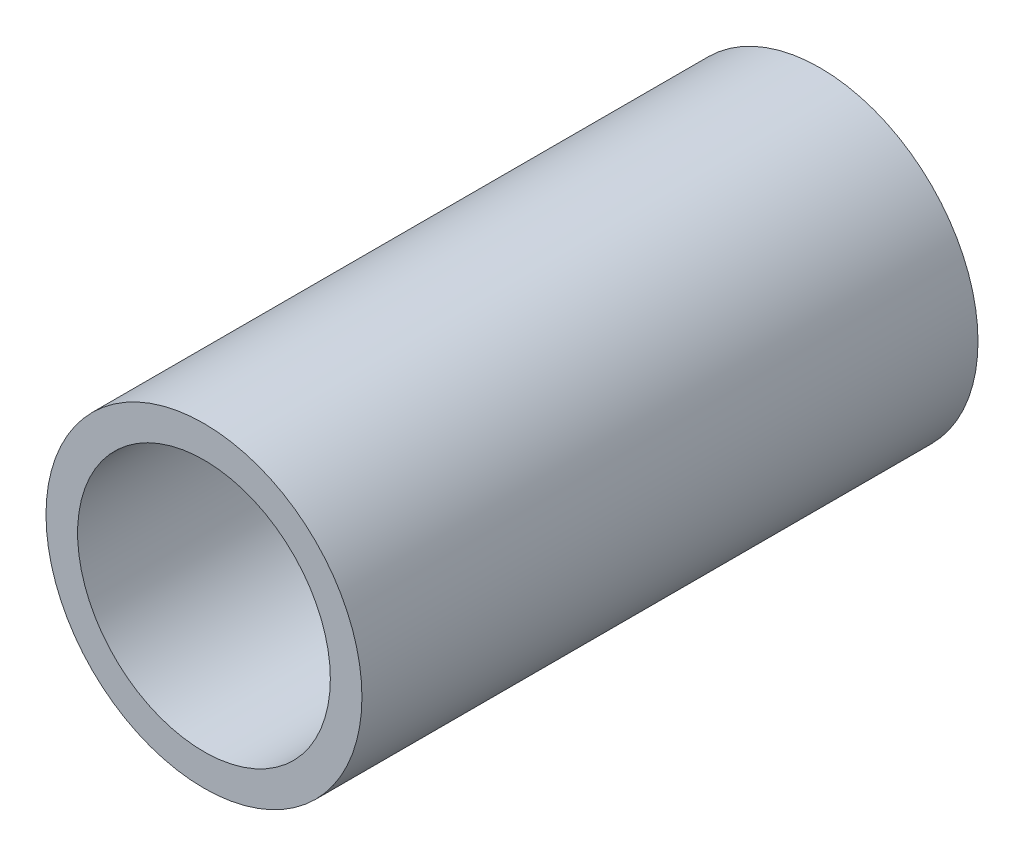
from build123d import *

# Parameters (mm, degrees)
SKETCH_1_R      = 5
SKETCH_1_R_2    = 4
EXTRUDE_1_DEPTH = 19.5


with BuildPart() as part:
    # Sketch 1 → Extrude 1 (new body)
    with BuildSketch(Plane.XY):
        Circle(SKETCH_1_R)
        Circle(SKETCH_1_R_2, mode=Mode.SUBTRACT)
    extrude(amount=EXTRUDE_1_DEPTH)


solid = part.part
